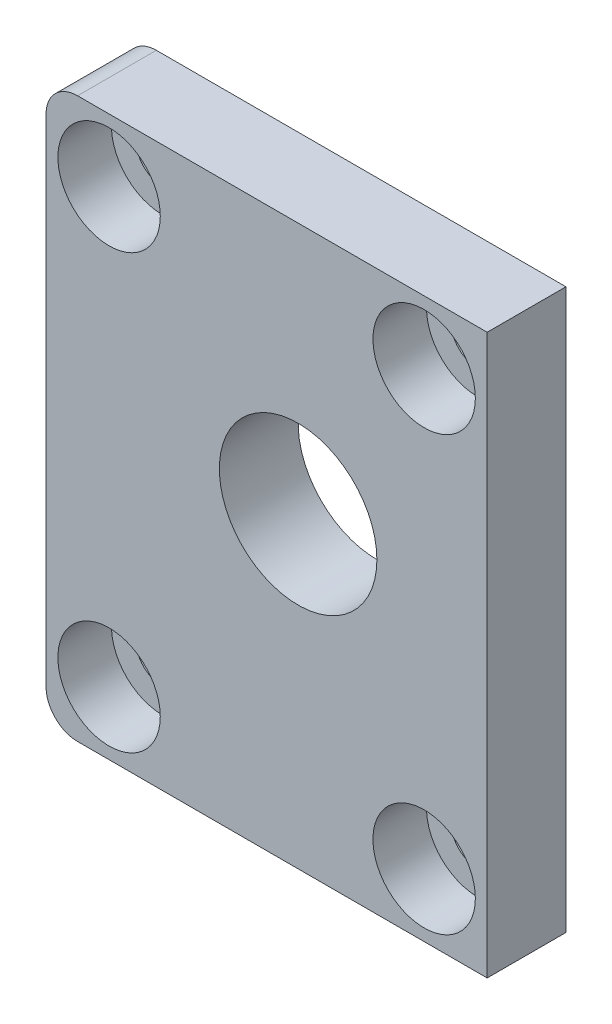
from build123d import *

# Parameters (mm, degrees)
SKIZZE1_W                                            = 28
SKIZZE1_H                                            = 35.5
SKIZZE1_R                                            = 5
AUFSATZ_LINEAR_AUSTRAGEN1_DEPTH                      = 5
STIRNSENKUNG_F_R_M3_ZYLINDERSCHRAUBE_MIT_D           = 3.4
STIRNSENKUNG_F_R_M3_ZYLINDERSCHRAUBE_MIT_CBORE_D     = 6.5
STIRNSENKUNG_F_R_M3_ZYLINDERSCHRAUBE_MIT_CBORE_DEPTH = 3.4
VERRUNDUNG1_R                                        = 2


with BuildPart() as part:
    # Skizze1 → Aufsatz-Linear austragen1 (new body)
    with BuildSketch(Plane.XY):
        Rectangle(SKIZZE1_W, SKIZZE1_H)
        with Locations((2, 1.75)):
            Circle(SKIZZE1_R, mode=Mode.SUBTRACT)
    extrude(amount=AUFSATZ_LINEAR_AUSTRAGEN1_DEPTH)

    # Stirnsenkung f_r M3 Zylinderschraube mit (through all)
    with Locations(Plane.XY.offset(5)):
        with Locations((-10, 13.75), (10, 13.75), (10, -13.75), (-10, -13.75)):
            CounterBoreHole(STIRNSENKUNG_F_R_M3_ZYLINDERSCHRAUBE_MIT_D / 2, STIRNSENKUNG_F_R_M3_ZYLINDERSCHRAUBE_MIT_CBORE_D / 2, STIRNSENKUNG_F_R_M3_ZYLINDERSCHRAUBE_MIT_CBORE_DEPTH)

    # Verrundung1
    verrundung1_edges = [part.edges().sort_by_distance(p)[0] for p in [
        (-14, -17.75, 2.5),
        (-14, 17.75, 2.5),
    ]]
    fillet(verrundung1_edges, radius=VERRUNDUNG1_R)


solid = part.part
